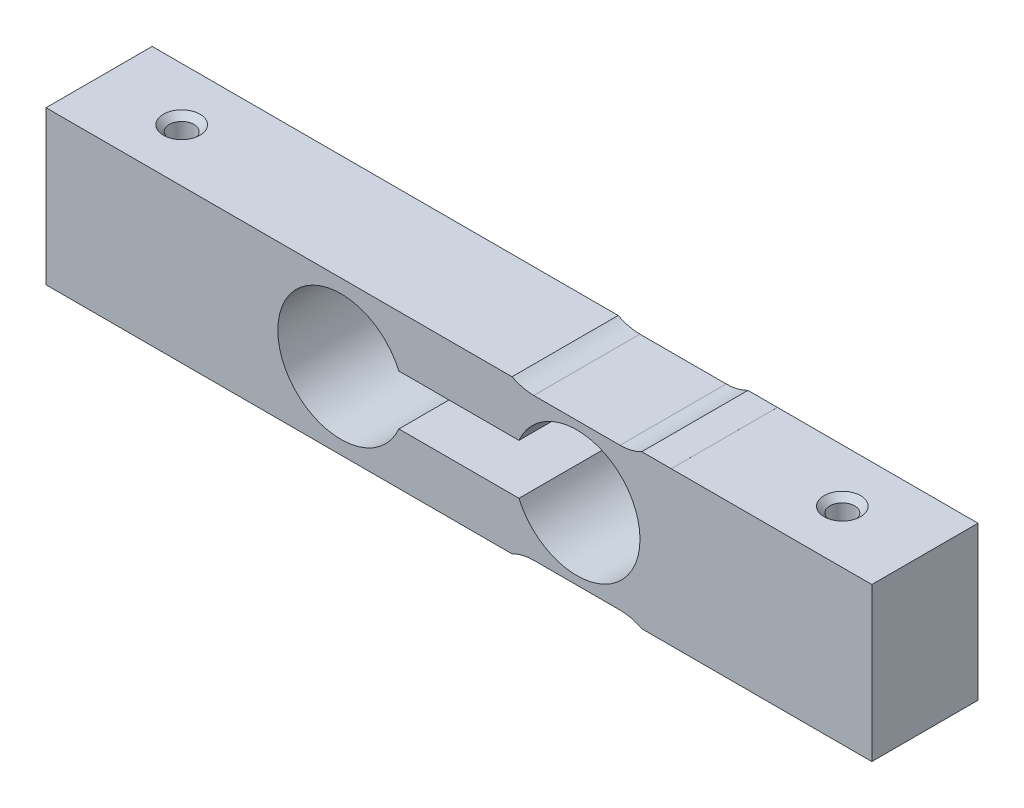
ISO-10303-21;
HEADER;
FILE_DESCRIPTION(('STEP AP214'),'2;1');
FILE_NAME('part.step','',(''),(''),'','','');
FILE_SCHEMA(('AUTOMOTIVE_DESIGN { 1 0 10303 214 1 1 1 1 }'));
ENDSEC;
DATA;
#1=APPLICATION_CONTEXT('core data for automotive mechanical design processes');
#2=APPLICATION_PROTOCOL_DEFINITION('international standard','automotive_design',2000,#1);
#3=PRODUCT_CONTEXT('',#1,'mechanical');
#4=PRODUCT('Part','Part','',(#3));
#5=PRODUCT_RELATED_PRODUCT_CATEGORY('part','',(#4));
#6=PRODUCT_DEFINITION_FORMATION('','',#4);
#7=PRODUCT_DEFINITION_CONTEXT('part definition',#1,'design');
#8=PRODUCT_DEFINITION('design','',#6,#7);
#9=PRODUCT_DEFINITION_SHAPE('','',#8);
#10=(LENGTH_UNIT() NAMED_UNIT(*) SI_UNIT(.MILLI.,.METRE.));
#11=(NAMED_UNIT(*) PLANE_ANGLE_UNIT() SI_UNIT($,.RADIAN.));
#12=(NAMED_UNIT(*) SI_UNIT($,.STERADIAN.) SOLID_ANGLE_UNIT());
#13=UNCERTAINTY_MEASURE_WITH_UNIT(LENGTH_MEASURE(1.E-05),#10,'distance_accuracy_value','');
#14=(GEOMETRIC_REPRESENTATION_CONTEXT(3) GLOBAL_UNCERTAINTY_ASSIGNED_CONTEXT((#13)) GLOBAL_UNIT_ASSIGNED_CONTEXT((#10,
#11,#12)) REPRESENTATION_CONTEXT('',''));
#15=CARTESIAN_POINT('',(0.,0.,0.));
#16=DIRECTION('',(0.,0.,1.));
#17=DIRECTION('',(1.,0.,0.));
#18=AXIS2_PLACEMENT_3D('',#15,#16,#17);
#19=CARTESIAN_POINT('',(140.,0.,18.));
#20=DIRECTION('',(-1.,0.,0.));
#21=DIRECTION('',(0.,0.,1.));
#22=AXIS2_PLACEMENT_3D('',#19,#20,#21);
#23=PLANE('',#22);
#24=DIRECTION('',(0.,0.,-1.));
#25=VECTOR('',#24,1.);
#26=CARTESIAN_POINT('',(140.,25.999,18.));
#27=LINE('',#26,#25);
#28=CARTESIAN_POINT('',(140.,25.999,18.));
#29=VERTEX_POINT('',#28);
#30=CARTESIAN_POINT('',(140.,25.999,0.));
#31=VERTEX_POINT('',#30);
#32=EDGE_CURVE('E175',#29,#31,#27,.T.);
#33=ORIENTED_EDGE('',*,*,#32,.F.);
#34=DIRECTION('',(0.,1.,0.));
#35=VECTOR('',#34,1.);
#36=CARTESIAN_POINT('',(140.,0.,18.));
#37=LINE('',#36,#35);
#38=CARTESIAN_POINT('',(140.,0.,18.));
#39=VERTEX_POINT('',#38);
#40=EDGE_CURVE('E319',#39,#29,#37,.T.);
#41=ORIENTED_EDGE('',*,*,#40,.F.);
#42=DIRECTION('',(0.,0.,-1.));
#43=VECTOR('',#42,1.);
#44=CARTESIAN_POINT('',(140.,0.,18.));
#45=LINE('',#44,#43);
#46=CARTESIAN_POINT('',(140.,0.,0.));
#47=VERTEX_POINT('',#46);
#48=EDGE_CURVE('E199',#39,#47,#45,.T.);
#49=ORIENTED_EDGE('',*,*,#48,.T.);
#50=DIRECTION('',(0.,1.,0.));
#51=VECTOR('',#50,1.);
#52=CARTESIAN_POINT('',(140.,0.,0.));
#53=LINE('',#52,#51);
#54=EDGE_CURVE('E193',#47,#31,#53,.T.);
#55=ORIENTED_EDGE('',*,*,#54,.T.);
#56=EDGE_LOOP('',(#33,#41,#49,#55));
#57=FACE_BOUND('',#56,.T.);
#58=ADVANCED_FACE('F36',(#57),#23,.F.);
#59=CARTESIAN_POINT('',(126.,25.,9.));
#60=DIRECTION('',(0.,1.,0.));
#61=DIRECTION('',(0.,0.,1.));
#62=AXIS2_PLACEMENT_3D('',#59,#60,#61);
#63=CONICAL_SURFACE('',#62,2.09999999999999,0.785398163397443);
#64=CARTESIAN_POINT('',(126.,25.,9.));
#65=DIRECTION('',(0.,-1.,0.));
#66=DIRECTION('',(0.,0.,-1.));
#67=AXIS2_PLACEMENT_3D('',#64,#65,#66);
#68=CIRCLE('',#67,2.09999999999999);
#69=CARTESIAN_POINT('',(126.,25.,6.90000000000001));
#70=VERTEX_POINT('',#69);
#71=EDGE_CURVE('E45',#70,#70,#68,.F.);
#72=ORIENTED_EDGE('',*,*,#71,.F.);
#73=EDGE_LOOP('',(#72));
#74=FACE_BOUND('',#73,.T.);
#75=CARTESIAN_POINT('',(126.,25.999,9.));
#76=DIRECTION('',(0.,1.,0.));
#77=DIRECTION('',(0.,0.,1.));
#78=AXIS2_PLACEMENT_3D('',#75,#76,#77);
#79=CIRCLE('',#78,3.099);
#80=CARTESIAN_POINT('',(126.,25.999,12.099));
#81=VERTEX_POINT('',#80);
#82=EDGE_CURVE('E40',#81,#81,#79,.T.);
#83=ORIENTED_EDGE('',*,*,#82,.T.);
#84=EDGE_LOOP('',(#83));
#85=FACE_BOUND('',#84,.T.);
#86=ADVANCED_FACE('F424',(#74,#85),#63,.F.);
#87=CARTESIAN_POINT('',(0.,0.,18.));
#88=DIRECTION('',(1.,0.,0.));
#89=DIRECTION('',(0.,0.,-1.));
#90=AXIS2_PLACEMENT_3D('',#87,#88,#89);
#91=PLANE('',#90);
#92=DIRECTION('',(0.,0.,-1.));
#93=VECTOR('',#92,1.);
#94=CARTESIAN_POINT('',(0.,0.001,18.));
#95=LINE('',#94,#93);
#96=CARTESIAN_POINT('',(0.,0.001,18.));
#97=VERTEX_POINT('',#96);
#98=CARTESIAN_POINT('',(0.,0.001,0.));
#99=VERTEX_POINT('',#98);
#100=EDGE_CURVE('E361',#97,#99,#95,.T.);
#101=ORIENTED_EDGE('',*,*,#100,.F.);
#102=DIRECTION('',(0.,-1.,0.));
#103=VECTOR('',#102,1.);
#104=CARTESIAN_POINT('',(0.,0.,18.));
#105=LINE('',#104,#103);
#106=CARTESIAN_POINT('',(0.,26.,18.));
#107=VERTEX_POINT('',#106);
#108=EDGE_CURVE('E216',#107,#97,#105,.T.);
#109=ORIENTED_EDGE('',*,*,#108,.F.);
#110=DIRECTION('',(0.,0.,-1.));
#111=VECTOR('',#110,1.);
#112=CARTESIAN_POINT('',(0.,26.,18.));
#113=LINE('',#112,#111);
#114=CARTESIAN_POINT('',(0.,26.,0.));
#115=VERTEX_POINT('',#114);
#116=EDGE_CURVE('E217',#107,#115,#113,.T.);
#117=ORIENTED_EDGE('',*,*,#116,.T.);
#118=DIRECTION('',(0.,-1.,0.));
#119=VECTOR('',#118,1.);
#120=CARTESIAN_POINT('',(0.,0.,0.));
#121=LINE('',#120,#119);
#122=EDGE_CURVE('E306',#115,#99,#121,.T.);
#123=ORIENTED_EDGE('',*,*,#122,.T.);
#124=EDGE_LOOP('',(#101,#109,#117,#123));
#125=FACE_BOUND('',#124,.T.);
#126=ADVANCED_FACE('F385',(#125),#91,.F.);
#127=CARTESIAN_POINT('',(14.,0.,9.));
#128=DIRECTION('',(0.,-1.,0.));
#129=DIRECTION('',(0.,0.,-1.));
#130=AXIS2_PLACEMENT_3D('',#127,#128,#129);
#131=CONICAL_SURFACE('',#130,3.1,0.785398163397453);
#132=CARTESIAN_POINT('',(14.,1.00000000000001,9.));
#133=DIRECTION('',(0.,1.,0.));
#134=DIRECTION('',(0.,0.,1.));
#135=AXIS2_PLACEMENT_3D('',#132,#133,#134);
#136=CIRCLE('',#135,2.09999999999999);
#137=CARTESIAN_POINT('',(14.,1.00000000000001,11.1));
#138=VERTEX_POINT('',#137);
#139=EDGE_CURVE('E246',#138,#138,#136,.F.);
#140=ORIENTED_EDGE('',*,*,#139,.F.);
#141=EDGE_LOOP('',(#140));
#142=FACE_BOUND('',#141,.T.);
#143=CARTESIAN_POINT('',(14.,0.001,9.));
#144=DIRECTION('',(0.,-1.,0.));
#145=DIRECTION('',(0.,0.,-1.));
#146=AXIS2_PLACEMENT_3D('',#143,#144,#145);
#147=CIRCLE('',#146,3.099);
#148=CARTESIAN_POINT('',(14.,0.001,5.901));
#149=VERTEX_POINT('',#148);
#150=EDGE_CURVE('E259',#149,#149,#147,.T.);
#151=ORIENTED_EDGE('',*,*,#150,.T.);
#152=EDGE_LOOP('',(#151));
#153=FACE_BOUND('',#152,.T.);
#154=ADVANCED_FACE('F38',(#142,#153),#131,.F.);
#155=CARTESIAN_POINT('',(82.6864617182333,33.1,18.));
#156=DIRECTION('',(0.,0.,-1.));
#157=DIRECTION('',(-1.,0.,0.));
#158=AXIS2_PLACEMENT_3D('',#155,#156,#157);
#159=PLANE('',#158);
#160=DIRECTION('',(1.,0.,0.));
#161=VECTOR('',#160,1.);
#162=CARTESIAN_POINT('',(140.,25.999,18.));
#163=LINE('',#162,#161);
#164=CARTESIAN_POINT('',(106.,25.999,18.));
#165=VERTEX_POINT('',#164);
#166=EDGE_CURVE('E181',#165,#29,#163,.T.);
#167=ORIENTED_EDGE('',*,*,#166,.F.);
#168=DIRECTION('',(0.,1.,0.));
#169=VECTOR('',#168,1.);
#170=CARTESIAN_POINT('',(106.,25.999,18.));
#171=LINE('',#170,#169);
#172=CARTESIAN_POINT('',(106.,26.,18.));
#173=VERTEX_POINT('',#172);
#174=EDGE_CURVE('E365',#165,#173,#171,.T.);
#175=ORIENTED_EDGE('',*,*,#174,.T.);
#176=DIRECTION('',(-1.,0.,0.));
#177=VECTOR('',#176,1.);
#178=CARTESIAN_POINT('',(101.,26.,18.));
#179=LINE('',#178,#177);
#180=CARTESIAN_POINT('',(101.,26.,18.));
#181=VERTEX_POINT('',#180);
#182=EDGE_CURVE('E321',#173,#181,#179,.T.);
#183=ORIENTED_EDGE('',*,*,#182,.T.);
#184=CARTESIAN_POINT('',(97.3135382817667,33.1,18.));
#185=DIRECTION('',(0.,0.,-1.));
#186=DIRECTION('',(1.,0.,0.));
#187=AXIS2_PLACEMENT_3D('',#184,#185,#186);
#188=CIRCLE('',#187,8.);
#189=CARTESIAN_POINT('',(97.3135382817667,25.1,18.));
#190=VERTEX_POINT('',#189);
#191=EDGE_CURVE('E323',#181,#190,#188,.T.);
#192=ORIENTED_EDGE('',*,*,#191,.T.);
#193=DIRECTION('',(-1.,0.,0.));
#194=VECTOR('',#193,1.);
#195=CARTESIAN_POINT('',(82.6864617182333,25.1,18.));
#196=LINE('',#195,#194);
#197=CARTESIAN_POINT('',(82.6864617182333,25.1,18.));
#198=VERTEX_POINT('',#197);
#199=EDGE_CURVE('E325',#190,#198,#196,.T.);
#200=ORIENTED_EDGE('',*,*,#199,.T.);
#201=CARTESIAN_POINT('',(82.6864617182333,33.1,18.));
#202=DIRECTION('',(0.,0.,-1.));
#203=DIRECTION('',(-1.,0.,0.));
#204=AXIS2_PLACEMENT_3D('',#201,#202,#203);
#205=CIRCLE('',#204,8.);
#206=CARTESIAN_POINT('',(79.,26.,18.));
#207=VERTEX_POINT('',#206);
#208=EDGE_CURVE('E327',#198,#207,#205,.T.);
#209=ORIENTED_EDGE('',*,*,#208,.T.);
#210=DIRECTION('',(-1.,0.,0.));
#211=VECTOR('',#210,1.);
#212=CARTESIAN_POINT('',(0.,26.,18.));
#213=LINE('',#212,#211);
#214=EDGE_CURVE('E221',#207,#107,#213,.T.);
#215=ORIENTED_EDGE('',*,*,#214,.T.);
#216=ORIENTED_EDGE('',*,*,#108,.T.);
#217=DIRECTION('',(-1.,0.,0.));
#218=VECTOR('',#217,1.);
#219=CARTESIAN_POINT('',(0.,0.001,18.));
#220=LINE('',#219,#218);
#221=CARTESIAN_POINT('',(34.4,0.001,18.));
#222=VERTEX_POINT('',#221);
#223=EDGE_CURVE('E273',#222,#97,#220,.T.);
#224=ORIENTED_EDGE('',*,*,#223,.F.);
#225=DIRECTION('',(0.,-1.,0.));
#226=VECTOR('',#225,1.);
#227=CARTESIAN_POINT('',(34.4,0.001,18.));
#228=LINE('',#227,#226);
#229=CARTESIAN_POINT('',(34.4,0.,18.));
#230=VERTEX_POINT('',#229);
#231=EDGE_CURVE('E262',#222,#230,#228,.T.);
#232=ORIENTED_EDGE('',*,*,#231,.T.);
#233=DIRECTION('',(1.,0.,0.));
#234=VECTOR('',#233,1.);
#235=CARTESIAN_POINT('',(0.,0.,18.));
#236=LINE('',#235,#234);
#237=CARTESIAN_POINT('',(79.,0.,18.));
#238=VERTEX_POINT('',#237);
#239=EDGE_CURVE('E309',#230,#238,#236,.T.);
#240=ORIENTED_EDGE('',*,*,#239,.T.);
#241=CARTESIAN_POINT('',(82.6864617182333,-7.10000000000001,18.));
#242=DIRECTION('',(0.,0.,-1.));
#243=DIRECTION('',(1.,0.,0.));
#244=AXIS2_PLACEMENT_3D('',#241,#242,#243);
#245=CIRCLE('',#244,8.);
#246=CARTESIAN_POINT('',(82.6864617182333,0.899999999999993,18.));
#247=VERTEX_POINT('',#246);
#248=EDGE_CURVE('E311',#238,#247,#245,.T.);
#249=ORIENTED_EDGE('',*,*,#248,.T.);
#250=DIRECTION('',(1.,0.,0.));
#251=VECTOR('',#250,1.);
#252=CARTESIAN_POINT('',(82.6864617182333,0.899999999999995,18.));
#253=LINE('',#252,#251);
#254=CARTESIAN_POINT('',(97.3135382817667,0.899999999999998,18.));
#255=VERTEX_POINT('',#254);
#256=EDGE_CURVE('E313',#247,#255,#253,.T.);
#257=ORIENTED_EDGE('',*,*,#256,.T.);
#258=CARTESIAN_POINT('',(97.3135382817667,-7.10000000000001,18.));
#259=DIRECTION('',(0.,0.,-1.));
#260=DIRECTION('',(-1.,0.,0.));
#261=AXIS2_PLACEMENT_3D('',#258,#259,#260);
#262=CIRCLE('',#261,8.);
#263=CARTESIAN_POINT('',(101.,0.,18.));
#264=VERTEX_POINT('',#263);
#265=EDGE_CURVE('E315',#255,#264,#262,.T.);
#266=ORIENTED_EDGE('',*,*,#265,.T.);
#267=DIRECTION('',(1.,0.,0.));
#268=VECTOR('',#267,1.);
#269=CARTESIAN_POINT('',(101.,0.,18.));
#270=LINE('',#269,#268);
#271=EDGE_CURVE('E317',#264,#39,#270,.T.);
#272=ORIENTED_EDGE('',*,*,#271,.T.);
#273=ORIENTED_EDGE('',*,*,#40,.T.);
#274=EDGE_LOOP('',(#167,#175,#183,#192,#200,#209,#215,#216,#224,#232,#240,#249,#257,#266,#272,#273));
#275=FACE_BOUND('',#274,.T.);
#276=CARTESIAN_POINT('',(50.,13.,18.));
#277=DIRECTION('',(0.,0.,1.));
#278=DIRECTION('',(1.,0.,0.));
#279=AXIS2_PLACEMENT_3D('',#276,#277,#278);
#280=CIRCLE('',#279,10.7);
#281=CARTESIAN_POINT('',(59.8197505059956,17.25,18.));
#282=VERTEX_POINT('',#281);
#283=CARTESIAN_POINT('',(59.8197505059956,8.75,18.));
#284=VERTEX_POINT('',#283);
#285=EDGE_CURVE('E279',#282,#284,#280,.T.);
#286=ORIENTED_EDGE('',*,*,#285,.F.);
#287=DIRECTION('',(-1.,0.,0.));
#288=VECTOR('',#287,1.);
#289=CARTESIAN_POINT('',(59.8197505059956,17.25,18.));
#290=LINE('',#289,#288);
#291=CARTESIAN_POINT('',(80.1802494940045,17.25,18.));
#292=VERTEX_POINT('',#291);
#293=EDGE_CURVE('E287',#292,#282,#290,.T.);
#294=ORIENTED_EDGE('',*,*,#293,.F.);
#295=CARTESIAN_POINT('',(90.,13.,18.));
#296=DIRECTION('',(0.,0.,1.));
#297=DIRECTION('',(1.,0.,0.));
#298=AXIS2_PLACEMENT_3D('',#295,#296,#297);
#299=CIRCLE('',#298,10.7);
#300=CARTESIAN_POINT('',(80.1802494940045,8.75,18.));
#301=VERTEX_POINT('',#300);
#302=EDGE_CURVE('E284',#301,#292,#299,.T.);
#303=ORIENTED_EDGE('',*,*,#302,.F.);
#304=DIRECTION('',(1.,0.,0.));
#305=VECTOR('',#304,1.);
#306=CARTESIAN_POINT('',(59.8197505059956,8.75,18.));
#307=LINE('',#306,#305);
#308=EDGE_CURVE('E281',#284,#301,#307,.T.);
#309=ORIENTED_EDGE('',*,*,#308,.F.);
#310=EDGE_LOOP('',(#286,#294,#303,#309));
#311=FACE_BOUND('',#310,.T.);
#312=ADVANCED_FACE('F347',(#275,#311),#159,.F.);
#313=CARTESIAN_POINT('',(82.6864617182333,33.1,0.));
#314=DIRECTION('',(0.,0.,-1.));
#315=DIRECTION('',(-1.,0.,0.));
#316=AXIS2_PLACEMENT_3D('',#313,#314,#315);
#317=PLANE('',#316);
#318=DIRECTION('',(0.,1.,0.));
#319=VECTOR('',#318,1.);
#320=CARTESIAN_POINT('',(106.,25.999,0.));
#321=LINE('',#320,#319);
#322=CARTESIAN_POINT('',(106.,25.999,0.));
#323=VERTEX_POINT('',#322);
#324=CARTESIAN_POINT('',(106.,26.,0.));
#325=VERTEX_POINT('',#324);
#326=EDGE_CURVE('E53',#323,#325,#321,.T.);
#327=ORIENTED_EDGE('',*,*,#326,.F.);
#328=DIRECTION('',(-1.,0.,0.));
#329=VECTOR('',#328,1.);
#330=CARTESIAN_POINT('',(140.,25.999,0.));
#331=LINE('',#330,#329);
#332=EDGE_CURVE('E179',#31,#323,#331,.T.);
#333=ORIENTED_EDGE('',*,*,#332,.F.);
#334=ORIENTED_EDGE('',*,*,#54,.F.);
#335=DIRECTION('',(1.,0.,0.));
#336=VECTOR('',#335,1.);
#337=CARTESIAN_POINT('',(101.,0.,0.));
#338=LINE('',#337,#336);
#339=CARTESIAN_POINT('',(101.,0.,0.));
#340=VERTEX_POINT('',#339);
#341=EDGE_CURVE('E201',#340,#47,#338,.T.);
#342=ORIENTED_EDGE('',*,*,#341,.F.);
#343=CARTESIAN_POINT('',(97.3135382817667,-7.10000000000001,0.));
#344=DIRECTION('',(0.,0.,-1.));
#345=DIRECTION('',(-1.,0.,0.));
#346=AXIS2_PLACEMENT_3D('',#343,#344,#345);
#347=CIRCLE('',#346,8.);
#348=CARTESIAN_POINT('',(97.3135382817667,0.899999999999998,0.));
#349=VERTEX_POINT('',#348);
#350=EDGE_CURVE('E205',#349,#340,#347,.T.);
#351=ORIENTED_EDGE('',*,*,#350,.F.);
#352=DIRECTION('',(1.,0.,0.));
#353=VECTOR('',#352,1.);
#354=CARTESIAN_POINT('',(82.6864617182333,0.899999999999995,0.));
#355=LINE('',#354,#353);
#356=CARTESIAN_POINT('',(82.6864617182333,0.899999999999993,0.));
#357=VERTEX_POINT('',#356);
#358=EDGE_CURVE('E336',#357,#349,#355,.T.);
#359=ORIENTED_EDGE('',*,*,#358,.F.);
#360=CARTESIAN_POINT('',(82.6864617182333,-7.10000000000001,0.));
#361=DIRECTION('',(0.,0.,-1.));
#362=DIRECTION('',(1.,0.,0.));
#363=AXIS2_PLACEMENT_3D('',#360,#361,#362);
#364=CIRCLE('',#363,8.);
#365=CARTESIAN_POINT('',(79.,0.,0.));
#366=VERTEX_POINT('',#365);
#367=EDGE_CURVE('E334',#366,#357,#364,.T.);
#368=ORIENTED_EDGE('',*,*,#367,.F.);
#369=DIRECTION('',(1.,0.,0.));
#370=VECTOR('',#369,1.);
#371=CARTESIAN_POINT('',(0.,0.,0.));
#372=LINE('',#371,#370);
#373=CARTESIAN_POINT('',(34.4,0.,0.));
#374=VERTEX_POINT('',#373);
#375=EDGE_CURVE('E332',#374,#366,#372,.T.);
#376=ORIENTED_EDGE('',*,*,#375,.F.);
#377=DIRECTION('',(0.,-1.,0.));
#378=VECTOR('',#377,1.);
#379=CARTESIAN_POINT('',(34.4,0.001,0.));
#380=LINE('',#379,#378);
#381=CARTESIAN_POINT('',(34.4,0.001,0.));
#382=VERTEX_POINT('',#381);
#383=EDGE_CURVE('E61',#382,#374,#380,.T.);
#384=ORIENTED_EDGE('',*,*,#383,.F.);
#385=DIRECTION('',(1.,0.,0.));
#386=VECTOR('',#385,1.);
#387=CARTESIAN_POINT('',(0.,0.001,0.));
#388=LINE('',#387,#386);
#389=EDGE_CURVE('E362',#99,#382,#388,.T.);
#390=ORIENTED_EDGE('',*,*,#389,.F.);
#391=ORIENTED_EDGE('',*,*,#122,.F.);
#392=DIRECTION('',(-1.,0.,0.));
#393=VECTOR('',#392,1.);
#394=CARTESIAN_POINT('',(0.,26.,0.));
#395=LINE('',#394,#393);
#396=CARTESIAN_POINT('',(79.,26.,0.));
#397=VERTEX_POINT('',#396);
#398=EDGE_CURVE('E214',#397,#115,#395,.T.);
#399=ORIENTED_EDGE('',*,*,#398,.F.);
#400=CARTESIAN_POINT('',(82.6864617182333,33.1,0.));
#401=DIRECTION('',(0.,0.,-1.));
#402=DIRECTION('',(-1.,0.,0.));
#403=AXIS2_PLACEMENT_3D('',#400,#401,#402);
#404=CIRCLE('',#403,8.);
#405=CARTESIAN_POINT('',(82.6864617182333,25.1,0.));
#406=VERTEX_POINT('',#405);
#407=EDGE_CURVE('E212',#406,#397,#404,.T.);
#408=ORIENTED_EDGE('',*,*,#407,.F.);
#409=DIRECTION('',(-1.,0.,0.));
#410=VECTOR('',#409,1.);
#411=CARTESIAN_POINT('',(82.6864617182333,25.1,0.));
#412=LINE('',#411,#410);
#413=CARTESIAN_POINT('',(97.3135382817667,25.1,0.));
#414=VERTEX_POINT('',#413);
#415=EDGE_CURVE('E210',#414,#406,#412,.T.);
#416=ORIENTED_EDGE('',*,*,#415,.F.);
#417=CARTESIAN_POINT('',(97.3135382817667,33.1,0.));
#418=DIRECTION('',(0.,0.,-1.));
#419=DIRECTION('',(1.,0.,0.));
#420=AXIS2_PLACEMENT_3D('',#417,#418,#419);
#421=CIRCLE('',#420,8.);
#422=CARTESIAN_POINT('',(101.,26.,0.));
#423=VERTEX_POINT('',#422);
#424=EDGE_CURVE('E203',#423,#414,#421,.T.);
#425=ORIENTED_EDGE('',*,*,#424,.F.);
#426=DIRECTION('',(-1.,0.,0.));
#427=VECTOR('',#426,1.);
#428=CARTESIAN_POINT('',(101.,26.,0.));
#429=LINE('',#428,#427);
#430=EDGE_CURVE('E200',#325,#423,#429,.T.);
#431=ORIENTED_EDGE('',*,*,#430,.F.);
#432=EDGE_LOOP('',(#327,#333,#334,#342,#351,#359,#368,#376,#384,#390,#391,#399,#408,#416,#425,#431));
#433=FACE_BOUND('',#432,.T.);
#434=DIRECTION('',(-1.,0.,0.));
#435=VECTOR('',#434,1.);
#436=CARTESIAN_POINT('',(59.8197505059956,17.25,0.));
#437=LINE('',#436,#435);
#438=CARTESIAN_POINT('',(80.1802494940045,17.25,0.));
#439=VERTEX_POINT('',#438);
#440=CARTESIAN_POINT('',(59.8197505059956,17.25,0.));
#441=VERTEX_POINT('',#440);
#442=EDGE_CURVE('E282',#439,#441,#437,.T.);
#443=ORIENTED_EDGE('',*,*,#442,.T.);
#444=CARTESIAN_POINT('',(50.,13.,0.));
#445=DIRECTION('',(0.,0.,1.));
#446=DIRECTION('',(1.,0.,0.));
#447=AXIS2_PLACEMENT_3D('',#444,#445,#446);
#448=CIRCLE('',#447,10.7);
#449=CARTESIAN_POINT('',(59.8197505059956,8.75,0.));
#450=VERTEX_POINT('',#449);
#451=EDGE_CURVE('E261',#441,#450,#448,.T.);
#452=ORIENTED_EDGE('',*,*,#451,.T.);
#453=DIRECTION('',(1.,0.,0.));
#454=VECTOR('',#453,1.);
#455=CARTESIAN_POINT('',(59.8197505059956,8.75,0.));
#456=LINE('',#455,#454);
#457=CARTESIAN_POINT('',(80.1802494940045,8.75,0.));
#458=VERTEX_POINT('',#457);
#459=EDGE_CURVE('E266',#450,#458,#456,.T.);
#460=ORIENTED_EDGE('',*,*,#459,.T.);
#461=CARTESIAN_POINT('',(90.,13.,0.));
#462=DIRECTION('',(0.,0.,1.));
#463=DIRECTION('',(1.,0.,0.));
#464=AXIS2_PLACEMENT_3D('',#461,#462,#463);
#465=CIRCLE('',#464,10.7);
#466=EDGE_CURVE('E292',#458,#439,#465,.T.);
#467=ORIENTED_EDGE('',*,*,#466,.T.);
#468=EDGE_LOOP('',(#443,#452,#460,#467));
#469=FACE_BOUND('',#468,.T.);
#470=ADVANCED_FACE('F190',(#433,#469),#317,.T.);
#471=CARTESIAN_POINT('',(0.,0.,18.));
#472=DIRECTION('',(0.,1.,0.));
#473=DIRECTION('',(0.,0.,1.));
#474=AXIS2_PLACEMENT_3D('',#471,#472,#473);
#475=PLANE('',#474);
#476=ORIENTED_EDGE('',*,*,#239,.F.);
#477=DIRECTION('',(0.,0.,1.));
#478=VECTOR('',#477,1.);
#479=CARTESIAN_POINT('',(34.4,0.,18.));
#480=LINE('',#479,#478);
#481=EDGE_CURVE('E276',#374,#230,#480,.T.);
#482=ORIENTED_EDGE('',*,*,#481,.F.);
#483=ORIENTED_EDGE('',*,*,#375,.T.);
#484=DIRECTION('',(0.,0.,-1.));
#485=VECTOR('',#484,1.);
#486=CARTESIAN_POINT('',(79.,0.,18.));
#487=LINE('',#486,#485);
#488=EDGE_CURVE('E243',#238,#366,#487,.T.);
#489=ORIENTED_EDGE('',*,*,#488,.F.);
#490=EDGE_LOOP('',(#476,#482,#483,#489));
#491=FACE_BOUND('',#490,.T.);
#492=ADVANCED_FACE('F360',(#491),#475,.F.);
#493=CARTESIAN_POINT('',(82.6864617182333,-7.10000000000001,18.));
#494=DIRECTION('',(0.,0.,-1.));
#495=DIRECTION('',(-1.,0.,0.));
#496=AXIS2_PLACEMENT_3D('',#493,#494,#495);
#497=CYLINDRICAL_SURFACE('',#496,8.);
#498=ORIENTED_EDGE('',*,*,#367,.T.);
#499=DIRECTION('',(0.,0.,-1.));
#500=VECTOR('',#499,1.);
#501=CARTESIAN_POINT('',(82.6864617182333,0.899999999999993,18.));
#502=LINE('',#501,#500);
#503=EDGE_CURVE('E240',#247,#357,#502,.T.);
#504=ORIENTED_EDGE('',*,*,#503,.F.);
#505=ORIENTED_EDGE('',*,*,#248,.F.);
#506=ORIENTED_EDGE('',*,*,#488,.T.);
#507=EDGE_LOOP('',(#498,#504,#505,#506));
#508=FACE_BOUND('',#507,.T.);
#509=ADVANCED_FACE('F357',(#508),#497,.F.);
#510=CARTESIAN_POINT('',(82.6864617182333,0.899999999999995,18.));
#511=DIRECTION('',(0.,1.,0.));
#512=DIRECTION('',(-1.,0.,0.));
#513=AXIS2_PLACEMENT_3D('',#510,#511,#512);
#514=PLANE('',#513);
#515=ORIENTED_EDGE('',*,*,#358,.T.);
#516=DIRECTION('',(0.,0.,-1.));
#517=VECTOR('',#516,1.);
#518=CARTESIAN_POINT('',(97.3135382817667,0.899999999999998,18.));
#519=LINE('',#518,#517);
#520=EDGE_CURVE('E237',#255,#349,#519,.T.);
#521=ORIENTED_EDGE('',*,*,#520,.F.);
#522=ORIENTED_EDGE('',*,*,#256,.F.);
#523=ORIENTED_EDGE('',*,*,#503,.T.);
#524=EDGE_LOOP('',(#515,#521,#522,#523));
#525=FACE_BOUND('',#524,.T.);
#526=ADVANCED_FACE('F353',(#525),#514,.F.);
#527=CARTESIAN_POINT('',(97.3135382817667,-7.10000000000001,18.));
#528=DIRECTION('',(0.,0.,-1.));
#529=DIRECTION('',(-1.,0.,0.));
#530=AXIS2_PLACEMENT_3D('',#527,#528,#529);
#531=CYLINDRICAL_SURFACE('',#530,8.);
#532=ORIENTED_EDGE('',*,*,#350,.T.);
#533=DIRECTION('',(0.,0.,-1.));
#534=VECTOR('',#533,1.);
#535=CARTESIAN_POINT('',(101.,0.,18.));
#536=LINE('',#535,#534);
#537=EDGE_CURVE('E234',#264,#340,#536,.T.);
#538=ORIENTED_EDGE('',*,*,#537,.F.);
#539=ORIENTED_EDGE('',*,*,#265,.F.);
#540=ORIENTED_EDGE('',*,*,#520,.T.);
#541=EDGE_LOOP('',(#532,#538,#539,#540));
#542=FACE_BOUND('',#541,.T.);
#543=ADVANCED_FACE('F340',(#542),#531,.F.);
#544=CARTESIAN_POINT('',(101.,0.,18.));
#545=DIRECTION('',(0.,1.,0.));
#546=DIRECTION('',(0.,0.,1.));
#547=AXIS2_PLACEMENT_3D('',#544,#545,#546);
#548=PLANE('',#547);
#549=CARTESIAN_POINT('',(126.,0.,9.));
#550=DIRECTION('',(0.,1.,0.));
#551=DIRECTION('',(0.,0.,1.));
#552=AXIS2_PLACEMENT_3D('',#549,#550,#551);
#553=CIRCLE('',#552,3.10000000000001);
#554=CARTESIAN_POINT('',(126.,0.,12.1));
#555=VERTEX_POINT('',#554);
#556=EDGE_CURVE('E11',#555,#555,#553,.T.);
#557=ORIENTED_EDGE('',*,*,#556,.T.);
#558=EDGE_LOOP('',(#557));
#559=FACE_BOUND('',#558,.T.);
#560=ORIENTED_EDGE('',*,*,#341,.T.);
#561=ORIENTED_EDGE('',*,*,#48,.F.);
#562=ORIENTED_EDGE('',*,*,#271,.F.);
#563=ORIENTED_EDGE('',*,*,#537,.T.);
#564=EDGE_LOOP('',(#560,#561,#562,#563));
#565=FACE_BOUND('',#564,.T.);
#566=ADVANCED_FACE('F346',(#559,#565),#548,.F.);
#567=CARTESIAN_POINT('',(101.,26.,18.));
#568=DIRECTION('',(0.,-1.,0.));
#569=DIRECTION('',(0.,0.,-1.));
#570=AXIS2_PLACEMENT_3D('',#567,#568,#569);
#571=PLANE('',#570);
#572=ORIENTED_EDGE('',*,*,#182,.F.);
#573=DIRECTION('',(0.,0.,1.));
#574=VECTOR('',#573,1.);
#575=CARTESIAN_POINT('',(106.,26.,18.));
#576=LINE('',#575,#574);
#577=EDGE_CURVE('E186',#325,#173,#576,.T.);
#578=ORIENTED_EDGE('',*,*,#577,.F.);
#579=ORIENTED_EDGE('',*,*,#430,.T.);
#580=DIRECTION('',(0.,0.,-1.));
#581=VECTOR('',#580,1.);
#582=CARTESIAN_POINT('',(101.,26.,18.));
#583=LINE('',#582,#581);
#584=EDGE_CURVE('E230',#181,#423,#583,.T.);
#585=ORIENTED_EDGE('',*,*,#584,.F.);
#586=EDGE_LOOP('',(#572,#578,#579,#585));
#587=FACE_BOUND('',#586,.T.);
#588=ADVANCED_FACE('F409',(#587),#571,.F.);
#589=CARTESIAN_POINT('',(97.3135382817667,33.1,18.));
#590=DIRECTION('',(0.,0.,-1.));
#591=DIRECTION('',(-1.,0.,0.));
#592=AXIS2_PLACEMENT_3D('',#589,#590,#591);
#593=CYLINDRICAL_SURFACE('',#592,8.);
#594=ORIENTED_EDGE('',*,*,#424,.T.);
#595=DIRECTION('',(0.,0.,-1.));
#596=VECTOR('',#595,1.);
#597=CARTESIAN_POINT('',(97.3135382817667,25.1,18.));
#598=LINE('',#597,#596);
#599=EDGE_CURVE('E227',#190,#414,#598,.T.);
#600=ORIENTED_EDGE('',*,*,#599,.F.);
#601=ORIENTED_EDGE('',*,*,#191,.F.);
#602=ORIENTED_EDGE('',*,*,#584,.T.);
#603=EDGE_LOOP('',(#594,#600,#601,#602));
#604=FACE_BOUND('',#603,.T.);
#605=ADVANCED_FACE('F406',(#604),#593,.F.);
#606=CARTESIAN_POINT('',(82.6864617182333,25.1,18.));
#607=DIRECTION('',(0.,-1.,0.));
#608=DIRECTION('',(1.,0.,0.));
#609=AXIS2_PLACEMENT_3D('',#606,#607,#608);
#610=PLANE('',#609);
#611=ORIENTED_EDGE('',*,*,#415,.T.);
#612=DIRECTION('',(0.,0.,-1.));
#613=VECTOR('',#612,1.);
#614=CARTESIAN_POINT('',(82.6864617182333,25.1,18.));
#615=LINE('',#614,#613);
#616=EDGE_CURVE('E224',#198,#406,#615,.T.);
#617=ORIENTED_EDGE('',*,*,#616,.F.);
#618=ORIENTED_EDGE('',*,*,#199,.F.);
#619=ORIENTED_EDGE('',*,*,#599,.T.);
#620=EDGE_LOOP('',(#611,#617,#618,#619));
#621=FACE_BOUND('',#620,.T.);
#622=ADVANCED_FACE('F402',(#621),#610,.F.);
#623=CARTESIAN_POINT('',(82.6864617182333,33.1,18.));
#624=DIRECTION('',(0.,0.,-1.));
#625=DIRECTION('',(-1.,0.,0.));
#626=AXIS2_PLACEMENT_3D('',#623,#624,#625);
#627=CYLINDRICAL_SURFACE('',#626,8.);
#628=ORIENTED_EDGE('',*,*,#407,.T.);
#629=DIRECTION('',(0.,0.,-1.));
#630=VECTOR('',#629,1.);
#631=CARTESIAN_POINT('',(79.,26.,18.));
#632=LINE('',#631,#630);
#633=EDGE_CURVE('E220',#207,#397,#632,.T.);
#634=ORIENTED_EDGE('',*,*,#633,.F.);
#635=ORIENTED_EDGE('',*,*,#208,.F.);
#636=ORIENTED_EDGE('',*,*,#616,.T.);
#637=EDGE_LOOP('',(#628,#634,#635,#636));
#638=FACE_BOUND('',#637,.T.);
#639=ADVANCED_FACE('F398',(#638),#627,.F.);
#640=CARTESIAN_POINT('',(0.,26.,18.));
#641=DIRECTION('',(0.,-1.,0.));
#642=DIRECTION('',(0.,0.,-1.));
#643=AXIS2_PLACEMENT_3D('',#640,#641,#642);
#644=PLANE('',#643);
#645=CARTESIAN_POINT('',(14.,26.,9.));
#646=DIRECTION('',(0.,-1.,0.));
#647=DIRECTION('',(0.,0.,-1.));
#648=AXIS2_PLACEMENT_3D('',#645,#646,#647);
#649=CIRCLE('',#648,3.1);
#650=CARTESIAN_POINT('',(14.,26.,5.9));
#651=VERTEX_POINT('',#650);
#652=EDGE_CURVE('E252',#651,#651,#649,.T.);
#653=ORIENTED_EDGE('',*,*,#652,.T.);
#654=EDGE_LOOP('',(#653));
#655=FACE_BOUND('',#654,.T.);
#656=ORIENTED_EDGE('',*,*,#398,.T.);
#657=ORIENTED_EDGE('',*,*,#116,.F.);
#658=ORIENTED_EDGE('',*,*,#214,.F.);
#659=ORIENTED_EDGE('',*,*,#633,.T.);
#660=EDGE_LOOP('',(#656,#657,#658,#659));
#661=FACE_BOUND('',#660,.T.);
#662=ADVANCED_FACE('F392',(#655,#661),#644,.F.);
#663=CARTESIAN_POINT('',(50.,13.,18.));
#664=DIRECTION('',(0.,0.,-1.));
#665=DIRECTION('',(-1.,0.,0.));
#666=AXIS2_PLACEMENT_3D('',#663,#664,#665);
#667=CYLINDRICAL_SURFACE('',#666,10.7);
#668=ORIENTED_EDGE('',*,*,#451,.F.);
#669=DIRECTION('',(0.,0.,-1.));
#670=VECTOR('',#669,1.);
#671=CARTESIAN_POINT('',(59.8197505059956,17.25,18.));
#672=LINE('',#671,#670);
#673=EDGE_CURVE('E288',#282,#441,#672,.T.);
#674=ORIENTED_EDGE('',*,*,#673,.F.);
#675=ORIENTED_EDGE('',*,*,#285,.T.);
#676=DIRECTION('',(0.,0.,-1.));
#677=VECTOR('',#676,1.);
#678=CARTESIAN_POINT('',(59.8197505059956,8.75,18.));
#679=LINE('',#678,#677);
#680=EDGE_CURVE('E303',#284,#450,#679,.T.);
#681=ORIENTED_EDGE('',*,*,#680,.T.);
#682=EDGE_LOOP('',(#668,#674,#675,#681));
#683=FACE_BOUND('',#682,.T.);
#684=ADVANCED_FACE('F483',(#683),#667,.F.);
#685=CARTESIAN_POINT('',(59.8197505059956,8.75,18.));
#686=DIRECTION('',(0.,1.,0.));
#687=DIRECTION('',(0.,0.,1.));
#688=AXIS2_PLACEMENT_3D('',#685,#686,#687);
#689=PLANE('',#688);
#690=ORIENTED_EDGE('',*,*,#459,.F.);
#691=ORIENTED_EDGE('',*,*,#680,.F.);
#692=ORIENTED_EDGE('',*,*,#308,.T.);
#693=DIRECTION('',(0.,0.,-1.));
#694=VECTOR('',#693,1.);
#695=CARTESIAN_POINT('',(80.1802494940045,8.75,18.));
#696=LINE('',#695,#694);
#697=EDGE_CURVE('E301',#301,#458,#696,.T.);
#698=ORIENTED_EDGE('',*,*,#697,.T.);
#699=EDGE_LOOP('',(#690,#691,#692,#698));
#700=FACE_BOUND('',#699,.T.);
#701=ADVANCED_FACE('F479',(#700),#689,.T.);
#702=CARTESIAN_POINT('',(90.,13.,18.));
#703=DIRECTION('',(0.,0.,-1.));
#704=DIRECTION('',(-1.,0.,0.));
#705=AXIS2_PLACEMENT_3D('',#702,#703,#704);
#706=CYLINDRICAL_SURFACE('',#705,10.7);
#707=ORIENTED_EDGE('',*,*,#466,.F.);
#708=ORIENTED_EDGE('',*,*,#697,.F.);
#709=ORIENTED_EDGE('',*,*,#302,.T.);
#710=DIRECTION('',(0.,0.,-1.));
#711=VECTOR('',#710,1.);
#712=CARTESIAN_POINT('',(80.1802494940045,17.25,18.));
#713=LINE('',#712,#711);
#714=EDGE_CURVE('E299',#292,#439,#713,.T.);
#715=ORIENTED_EDGE('',*,*,#714,.T.);
#716=EDGE_LOOP('',(#707,#708,#709,#715));
#717=FACE_BOUND('',#716,.T.);
#718=ADVANCED_FACE('F475',(#717),#706,.F.);
#719=CARTESIAN_POINT('',(59.8197505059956,17.25,18.));
#720=DIRECTION('',(0.,-1.,0.));
#721=DIRECTION('',(0.,0.,-1.));
#722=AXIS2_PLACEMENT_3D('',#719,#720,#721);
#723=PLANE('',#722);
#724=ORIENTED_EDGE('',*,*,#442,.F.);
#725=ORIENTED_EDGE('',*,*,#714,.F.);
#726=ORIENTED_EDGE('',*,*,#293,.T.);
#727=ORIENTED_EDGE('',*,*,#673,.T.);
#728=EDGE_LOOP('',(#724,#725,#726,#727));
#729=FACE_BOUND('',#728,.T.);
#730=ADVANCED_FACE('F469',(#729),#723,.T.);
#731=CARTESIAN_POINT('',(14.,26.,9.));
#732=DIRECTION('',(0.,1.,0.));
#733=DIRECTION('',(0.,0.,1.));
#734=AXIS2_PLACEMENT_3D('',#731,#732,#733);
#735=CYLINDRICAL_SURFACE('',#734,2.09999999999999);
#736=CARTESIAN_POINT('',(14.,25.,9.));
#737=DIRECTION('',(0.,-1.,0.));
#738=DIRECTION('',(0.,0.,-1.));
#739=AXIS2_PLACEMENT_3D('',#736,#737,#738);
#740=CIRCLE('',#739,2.09999999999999);
#741=CARTESIAN_POINT('',(14.,25.,6.90000000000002));
#742=VERTEX_POINT('',#741);
#743=EDGE_CURVE('E249',#742,#742,#740,.F.);
#744=ORIENTED_EDGE('',*,*,#743,.T.);
#745=EDGE_LOOP('',(#744));
#746=FACE_BOUND('',#745,.T.);
#747=ORIENTED_EDGE('',*,*,#139,.T.);
#748=EDGE_LOOP('',(#747));
#749=FACE_BOUND('',#748,.T.);
#750=ADVANCED_FACE('F463',(#746,#749),#735,.F.);
#751=CARTESIAN_POINT('',(126.,26.,9.));
#752=DIRECTION('',(0.,1.,0.));
#753=DIRECTION('',(0.,0.,1.));
#754=AXIS2_PLACEMENT_3D('',#751,#752,#753);
#755=CYLINDRICAL_SURFACE('',#754,2.09999999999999);
#756=ORIENTED_EDGE('',*,*,#71,.T.);
#757=EDGE_LOOP('',(#756));
#758=FACE_BOUND('',#757,.T.);
#759=CARTESIAN_POINT('',(126.,1.00000000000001,9.));
#760=DIRECTION('',(0.,1.,0.));
#761=DIRECTION('',(0.,0.,1.));
#762=AXIS2_PLACEMENT_3D('',#759,#760,#761);
#763=CIRCLE('',#762,2.09999999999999);
#764=CARTESIAN_POINT('',(126.,1.00000000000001,11.1));
#765=VERTEX_POINT('',#764);
#766=EDGE_CURVE('E255',#765,#765,#763,.F.);
#767=ORIENTED_EDGE('',*,*,#766,.T.);
#768=EDGE_LOOP('',(#767));
#769=FACE_BOUND('',#768,.T.);
#770=ADVANCED_FACE('F450',(#758,#769),#755,.F.);
#771=CARTESIAN_POINT('',(14.,25.,9.));
#772=DIRECTION('',(0.,1.,0.));
#773=DIRECTION('',(0.,0.,1.));
#774=AXIS2_PLACEMENT_3D('',#771,#772,#773);
#775=CONICAL_SURFACE('',#774,2.09999999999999,0.785398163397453);
#776=ORIENTED_EDGE('',*,*,#652,.F.);
#777=EDGE_LOOP('',(#776));
#778=FACE_BOUND('',#777,.T.);
#779=ORIENTED_EDGE('',*,*,#743,.F.);
#780=EDGE_LOOP('',(#779));
#781=FACE_BOUND('',#780,.T.);
#782=ADVANCED_FACE('F447',(#778,#781),#775,.F.);
#783=CARTESIAN_POINT('',(126.,0.,9.));
#784=DIRECTION('',(0.,-1.,0.));
#785=DIRECTION('',(0.,0.,-1.));
#786=AXIS2_PLACEMENT_3D('',#783,#784,#785);
#787=CONICAL_SURFACE('',#786,3.10000000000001,0.785398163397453);
#788=ORIENTED_EDGE('',*,*,#766,.F.);
#789=EDGE_LOOP('',(#788));
#790=FACE_BOUND('',#789,.T.);
#791=ORIENTED_EDGE('',*,*,#556,.F.);
#792=EDGE_LOOP('',(#791));
#793=FACE_BOUND('',#792,.T.);
#794=ADVANCED_FACE('F449',(#790,#793),#787,.F.);
#795=CARTESIAN_POINT('',(34.4,0.001,18.));
#796=DIRECTION('',(1.,0.,0.));
#797=DIRECTION('',(0.,0.,-1.));
#798=AXIS2_PLACEMENT_3D('',#795,#796,#797);
#799=PLANE('',#798);
#800=ORIENTED_EDGE('',*,*,#481,.T.);
#801=ORIENTED_EDGE('',*,*,#231,.F.);
#802=DIRECTION('',(0.,0.,1.));
#803=VECTOR('',#802,1.);
#804=CARTESIAN_POINT('',(34.4,0.001,18.));
#805=LINE('',#804,#803);
#806=EDGE_CURVE('E377',#382,#222,#805,.T.);
#807=ORIENTED_EDGE('',*,*,#806,.F.);
#808=ORIENTED_EDGE('',*,*,#383,.T.);
#809=EDGE_LOOP('',(#800,#801,#807,#808));
#810=FACE_BOUND('',#809,.T.);
#811=ADVANCED_FACE('F420',(#810),#799,.F.);
#812=CARTESIAN_POINT('',(0.,0.001,0.));
#813=DIRECTION('',(0.,-1.,0.));
#814=DIRECTION('',(0.,0.,-1.));
#815=AXIS2_PLACEMENT_3D('',#812,#813,#814);
#816=PLANE('',#815);
#817=ORIENTED_EDGE('',*,*,#150,.F.);
#818=EDGE_LOOP('',(#817));
#819=FACE_BOUND('',#818,.T.);
#820=ORIENTED_EDGE('',*,*,#100,.T.);
#821=ORIENTED_EDGE('',*,*,#389,.T.);
#822=ORIENTED_EDGE('',*,*,#806,.T.);
#823=ORIENTED_EDGE('',*,*,#223,.T.);
#824=EDGE_LOOP('',(#820,#821,#822,#823));
#825=FACE_BOUND('',#824,.T.);
#826=ADVANCED_FACE('F381',(#819,#825),#816,.T.);
#827=CARTESIAN_POINT('',(106.,25.999,18.));
#828=DIRECTION('',(-1.,0.,0.));
#829=DIRECTION('',(0.,0.,1.));
#830=AXIS2_PLACEMENT_3D('',#827,#828,#829);
#831=PLANE('',#830);
#832=ORIENTED_EDGE('',*,*,#577,.T.);
#833=ORIENTED_EDGE('',*,*,#174,.F.);
#834=DIRECTION('',(0.,0.,1.));
#835=VECTOR('',#834,1.);
#836=CARTESIAN_POINT('',(106.,25.999,18.));
#837=LINE('',#836,#835);
#838=EDGE_CURVE('E195',#323,#165,#837,.T.);
#839=ORIENTED_EDGE('',*,*,#838,.F.);
#840=ORIENTED_EDGE('',*,*,#326,.T.);
#841=EDGE_LOOP('',(#832,#833,#839,#840));
#842=FACE_BOUND('',#841,.T.);
#843=ADVANCED_FACE('F410',(#842),#831,.F.);
#844=CARTESIAN_POINT('',(140.,25.999,0.));
#845=DIRECTION('',(0.,1.,0.));
#846=DIRECTION('',(0.,0.,1.));
#847=AXIS2_PLACEMENT_3D('',#844,#845,#846);
#848=PLANE('',#847);
#849=ORIENTED_EDGE('',*,*,#82,.F.);
#850=EDGE_LOOP('',(#849));
#851=FACE_BOUND('',#850,.T.);
#852=ORIENTED_EDGE('',*,*,#32,.T.);
#853=ORIENTED_EDGE('',*,*,#332,.T.);
#854=ORIENTED_EDGE('',*,*,#838,.T.);
#855=ORIENTED_EDGE('',*,*,#166,.T.);
#856=EDGE_LOOP('',(#852,#853,#854,#855));
#857=FACE_BOUND('',#856,.T.);
#858=ADVANCED_FACE('F177',(#851,#857),#848,.T.);
#859=CLOSED_SHELL('',(#58,#86,#126,#154,#312,#470,#492,#509,#526,#543,#566,#588,#605,#622,#639,
#662,#684,#701,#718,#730,#750,#770,#782,#794,#811,#826,#843,#858));
#860=MANIFOLD_SOLID_BREP('B2',#859);
#861=ADVANCED_BREP_SHAPE_REPRESENTATION('',(#18,#860),#14);
#862=SHAPE_DEFINITION_REPRESENTATION(#9,#861);
ENDSEC;
END-ISO-10303-21;
